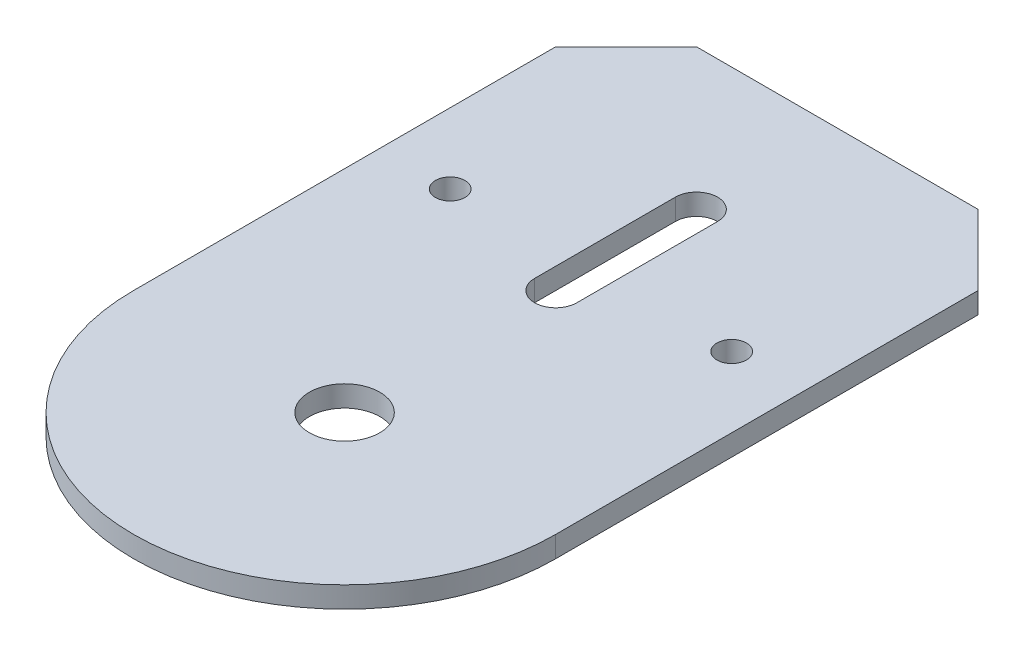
ISO-10303-21;
HEADER;
FILE_DESCRIPTION(('STEP AP214'),'2;1');
FILE_NAME('part.step','',(''),(''),'','','');
FILE_SCHEMA(('AUTOMOTIVE_DESIGN { 1 0 10303 214 1 1 1 1 }'));
ENDSEC;
DATA;
#1=APPLICATION_CONTEXT('core data for automotive mechanical design processes');
#2=APPLICATION_PROTOCOL_DEFINITION('international standard','automotive_design',2000,#1);
#3=PRODUCT_CONTEXT('',#1,'mechanical');
#4=PRODUCT('Part','Part','',(#3));
#5=PRODUCT_RELATED_PRODUCT_CATEGORY('part','',(#4));
#6=PRODUCT_DEFINITION_FORMATION('','',#4);
#7=PRODUCT_DEFINITION_CONTEXT('part definition',#1,'design');
#8=PRODUCT_DEFINITION('design','',#6,#7);
#9=PRODUCT_DEFINITION_SHAPE('','',#8);
#10=(LENGTH_UNIT() NAMED_UNIT(*) SI_UNIT(.MILLI.,.METRE.));
#11=(NAMED_UNIT(*) PLANE_ANGLE_UNIT() SI_UNIT($,.RADIAN.));
#12=(NAMED_UNIT(*) SI_UNIT($,.STERADIAN.) SOLID_ANGLE_UNIT());
#13=UNCERTAINTY_MEASURE_WITH_UNIT(LENGTH_MEASURE(1.E-05),#10,'distance_accuracy_value','');
#14=(GEOMETRIC_REPRESENTATION_CONTEXT(3) GLOBAL_UNCERTAINTY_ASSIGNED_CONTEXT((#13)) GLOBAL_UNIT_ASSIGNED_CONTEXT((#10,
#11,#12)) REPRESENTATION_CONTEXT('',''));
#15=CARTESIAN_POINT('',(0.,0.,0.));
#16=DIRECTION('',(0.,0.,1.));
#17=DIRECTION('',(1.,0.,0.));
#18=AXIS2_PLACEMENT_3D('',#15,#16,#17);
#19=CARTESIAN_POINT('',(0.,3.,0.));
#20=DIRECTION('',(0.,1.,0.));
#21=DIRECTION('',(0.,0.,1.));
#22=AXIS2_PLACEMENT_3D('',#19,#20,#21);
#23=PLANE('',#22);
#24=CARTESIAN_POINT('',(-20.,3.,-35.));
#25=DIRECTION('',(0.,1.,0.));
#26=DIRECTION('',(0.,0.,1.));
#27=AXIS2_PLACEMENT_3D('',#24,#25,#26);
#28=CIRCLE('',#27,2.1);
#29=CARTESIAN_POINT('',(-20.,3.,-32.9));
#30=VERTEX_POINT('',#29);
#31=EDGE_CURVE('E266',#30,#30,#28,.T.);
#32=ORIENTED_EDGE('',*,*,#31,.F.);
#33=EDGE_LOOP('',(#32));
#34=FACE_BOUND('',#33,.T.);
#35=CARTESIAN_POINT('',(20.,3.,-35.));
#36=DIRECTION('',(0.,1.,0.));
#37=DIRECTION('',(0.,0.,1.));
#38=AXIS2_PLACEMENT_3D('',#35,#36,#37);
#39=CIRCLE('',#38,2.1);
#40=CARTESIAN_POINT('',(20.,3.,-32.9));
#41=VERTEX_POINT('',#40);
#42=EDGE_CURVE('E268',#41,#41,#39,.T.);
#43=ORIENTED_EDGE('',*,*,#42,.F.);
#44=EDGE_LOOP('',(#43));
#45=FACE_BOUND('',#44,.T.);
#46=CARTESIAN_POINT('',(0.,3.,0.));
#47=DIRECTION('',(0.,1.,0.));
#48=DIRECTION('',(0.,0.,1.));
#49=AXIS2_PLACEMENT_3D('',#46,#47,#48);
#50=CIRCLE('',#49,5.);
#51=CARTESIAN_POINT('',(0.,3.,5.));
#52=VERTEX_POINT('',#51);
#53=EDGE_CURVE('E146',#52,#52,#50,.T.);
#54=ORIENTED_EDGE('',*,*,#53,.F.);
#55=EDGE_LOOP('',(#54));
#56=FACE_BOUND('',#55,.T.);
#57=DIRECTION('',(-0.707106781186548,0.,0.707106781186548));
#58=VECTOR('',#57,1.);
#59=CARTESIAN_POINT('',(-30.,3.,-60.));
#60=LINE('',#59,#58);
#61=CARTESIAN_POINT('',(-20.,3.,-70.));
#62=VERTEX_POINT('',#61);
#63=CARTESIAN_POINT('',(-30.,3.,-60.));
#64=VERTEX_POINT('',#63);
#65=EDGE_CURVE('E152',#62,#64,#60,.T.);
#66=ORIENTED_EDGE('',*,*,#65,.T.);
#67=DIRECTION('',(0.,0.,1.));
#68=VECTOR('',#67,1.);
#69=CARTESIAN_POINT('',(-30.,3.,0.));
#70=LINE('',#69,#68);
#71=CARTESIAN_POINT('',(-30.,3.,0.));
#72=VERTEX_POINT('',#71);
#73=EDGE_CURVE('E155',#64,#72,#70,.T.);
#74=ORIENTED_EDGE('',*,*,#73,.T.);
#75=CARTESIAN_POINT('',(0.,3.,0.));
#76=DIRECTION('',(0.,1.,0.));
#77=DIRECTION('',(0.,0.,1.));
#78=AXIS2_PLACEMENT_3D('',#75,#76,#77);
#79=CIRCLE('',#78,30.);
#80=CARTESIAN_POINT('',(30.,3.,0.));
#81=VERTEX_POINT('',#80);
#82=EDGE_CURVE('E158',#72,#81,#79,.T.);
#83=ORIENTED_EDGE('',*,*,#82,.T.);
#84=DIRECTION('',(0.,0.,-1.));
#85=VECTOR('',#84,1.);
#86=CARTESIAN_POINT('',(30.,3.,-60.));
#87=LINE('',#86,#85);
#88=CARTESIAN_POINT('',(30.,3.,-60.));
#89=VERTEX_POINT('',#88);
#90=EDGE_CURVE('E160',#81,#89,#87,.T.);
#91=ORIENTED_EDGE('',*,*,#90,.T.);
#92=DIRECTION('',(-0.707106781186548,0.,-0.707106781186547));
#93=VECTOR('',#92,1.);
#94=CARTESIAN_POINT('',(20.,3.,-70.));
#95=LINE('',#94,#93);
#96=CARTESIAN_POINT('',(20.,3.,-70.));
#97=VERTEX_POINT('',#96);
#98=EDGE_CURVE('E162',#89,#97,#95,.T.);
#99=ORIENTED_EDGE('',*,*,#98,.T.);
#100=DIRECTION('',(-1.,0.,0.));
#101=VECTOR('',#100,1.);
#102=CARTESIAN_POINT('',(-20.,3.,-70.));
#103=LINE('',#102,#101);
#104=EDGE_CURVE('E164',#97,#62,#103,.T.);
#105=ORIENTED_EDGE('',*,*,#104,.T.);
#106=EDGE_LOOP('',(#66,#74,#83,#91,#99,#105));
#107=FACE_BOUND('',#106,.T.);
#108=DIRECTION('',(0.,0.,-1.));
#109=VECTOR('',#108,1.);
#110=CARTESIAN_POINT('',(3.,3.,-30.));
#111=LINE('',#110,#109);
#112=CARTESIAN_POINT('',(3.,3.,-30.));
#113=VERTEX_POINT('',#112);
#114=CARTESIAN_POINT('',(3.,3.,-50.));
#115=VERTEX_POINT('',#114);
#116=EDGE_CURVE('E116',#113,#115,#111,.T.);
#117=ORIENTED_EDGE('',*,*,#116,.F.);
#118=CARTESIAN_POINT('',(0.,3.,-30.));
#119=DIRECTION('',(0.,1.,0.));
#120=DIRECTION('',(0.,0.,-1.));
#121=AXIS2_PLACEMENT_3D('',#118,#119,#120);
#122=CIRCLE('',#121,3.);
#123=CARTESIAN_POINT('',(-3.,3.,-30.));
#124=VERTEX_POINT('',#123);
#125=EDGE_CURVE('E108',#124,#113,#122,.T.);
#126=ORIENTED_EDGE('',*,*,#125,.F.);
#127=DIRECTION('',(0.,0.,1.));
#128=VECTOR('',#127,1.);
#129=CARTESIAN_POINT('',(-3.,3.,-30.));
#130=LINE('',#129,#128);
#131=CARTESIAN_POINT('',(-3.,3.,-50.));
#132=VERTEX_POINT('',#131);
#133=EDGE_CURVE('E130',#132,#124,#130,.T.);
#134=ORIENTED_EDGE('',*,*,#133,.F.);
#135=CARTESIAN_POINT('',(0.,3.,-50.));
#136=DIRECTION('',(0.,1.,0.));
#137=DIRECTION('',(0.,0.,1.));
#138=AXIS2_PLACEMENT_3D('',#135,#136,#137);
#139=CIRCLE('',#138,3.);
#140=EDGE_CURVE('E128',#115,#132,#139,.T.);
#141=ORIENTED_EDGE('',*,*,#140,.F.);
#142=EDGE_LOOP('',(#117,#126,#134,#141));
#143=FACE_BOUND('',#142,.T.);
#144=ADVANCED_FACE('F31',(#34,#45,#56,#107,#143),#23,.T.);
#145=CARTESIAN_POINT('',(0.,0.,0.));
#146=DIRECTION('',(0.,1.,0.));
#147=DIRECTION('',(0.,0.,1.));
#148=AXIS2_PLACEMENT_3D('',#145,#146,#147);
#149=PLANE('',#148);
#150=CARTESIAN_POINT('',(-20.,0.,-35.));
#151=DIRECTION('',(0.,1.,0.));
#152=DIRECTION('',(0.,0.,1.));
#153=AXIS2_PLACEMENT_3D('',#150,#151,#152);
#154=CIRCLE('',#153,2.1);
#155=CARTESIAN_POINT('',(-20.,0.,-32.9));
#156=VERTEX_POINT('',#155);
#157=EDGE_CURVE('E264',#156,#156,#154,.T.);
#158=ORIENTED_EDGE('',*,*,#157,.T.);
#159=EDGE_LOOP('',(#158));
#160=FACE_BOUND('',#159,.T.);
#161=CARTESIAN_POINT('',(20.,0.,-35.));
#162=DIRECTION('',(0.,1.,0.));
#163=DIRECTION('',(0.,0.,1.));
#164=AXIS2_PLACEMENT_3D('',#161,#162,#163);
#165=CIRCLE('',#164,2.1);
#166=CARTESIAN_POINT('',(20.,0.,-32.9));
#167=VERTEX_POINT('',#166);
#168=EDGE_CURVE('E136',#167,#167,#165,.T.);
#169=ORIENTED_EDGE('',*,*,#168,.T.);
#170=EDGE_LOOP('',(#169));
#171=FACE_BOUND('',#170,.T.);
#172=CARTESIAN_POINT('',(0.,0.,0.));
#173=DIRECTION('',(0.,1.,0.));
#174=DIRECTION('',(0.,0.,1.));
#175=AXIS2_PLACEMENT_3D('',#172,#173,#174);
#176=CIRCLE('',#175,5.);
#177=CARTESIAN_POINT('',(0.,0.,5.));
#178=VERTEX_POINT('',#177);
#179=EDGE_CURVE('E124',#178,#178,#176,.T.);
#180=ORIENTED_EDGE('',*,*,#179,.T.);
#181=EDGE_LOOP('',(#180));
#182=FACE_BOUND('',#181,.T.);
#183=DIRECTION('',(-0.707106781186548,0.,0.707106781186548));
#184=VECTOR('',#183,1.);
#185=CARTESIAN_POINT('',(-30.,0.,-60.));
#186=LINE('',#185,#184);
#187=CARTESIAN_POINT('',(-20.,0.,-70.));
#188=VERTEX_POINT('',#187);
#189=CARTESIAN_POINT('',(-30.,0.,-60.));
#190=VERTEX_POINT('',#189);
#191=EDGE_CURVE('E149',#188,#190,#186,.T.);
#192=ORIENTED_EDGE('',*,*,#191,.F.);
#193=DIRECTION('',(-1.,0.,0.));
#194=VECTOR('',#193,1.);
#195=CARTESIAN_POINT('',(-20.,0.,-70.));
#196=LINE('',#195,#194);
#197=CARTESIAN_POINT('',(20.,0.,-70.));
#198=VERTEX_POINT('',#197);
#199=EDGE_CURVE('E156',#198,#188,#196,.T.);
#200=ORIENTED_EDGE('',*,*,#199,.F.);
#201=DIRECTION('',(-0.707106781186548,0.,-0.707106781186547));
#202=VECTOR('',#201,1.);
#203=CARTESIAN_POINT('',(20.,0.,-70.));
#204=LINE('',#203,#202);
#205=CARTESIAN_POINT('',(30.,0.,-60.));
#206=VERTEX_POINT('',#205);
#207=EDGE_CURVE('E175',#206,#198,#204,.T.);
#208=ORIENTED_EDGE('',*,*,#207,.F.);
#209=DIRECTION('',(0.,0.,-1.));
#210=VECTOR('',#209,1.);
#211=CARTESIAN_POINT('',(30.,0.,-60.));
#212=LINE('',#211,#210);
#213=CARTESIAN_POINT('',(30.,0.,0.));
#214=VERTEX_POINT('',#213);
#215=EDGE_CURVE('E173',#214,#206,#212,.T.);
#216=ORIENTED_EDGE('',*,*,#215,.F.);
#217=CARTESIAN_POINT('',(0.,0.,0.));
#218=DIRECTION('',(0.,1.,0.));
#219=DIRECTION('',(0.,0.,1.));
#220=AXIS2_PLACEMENT_3D('',#217,#218,#219);
#221=CIRCLE('',#220,30.);
#222=CARTESIAN_POINT('',(-30.,0.,0.));
#223=VERTEX_POINT('',#222);
#224=EDGE_CURVE('E171',#223,#214,#221,.T.);
#225=ORIENTED_EDGE('',*,*,#224,.F.);
#226=DIRECTION('',(0.,0.,1.));
#227=VECTOR('',#226,1.);
#228=CARTESIAN_POINT('',(-30.,0.,0.));
#229=LINE('',#228,#227);
#230=EDGE_CURVE('E169',#190,#223,#229,.T.);
#231=ORIENTED_EDGE('',*,*,#230,.F.);
#232=EDGE_LOOP('',(#192,#200,#208,#216,#225,#231));
#233=FACE_BOUND('',#232,.T.);
#234=CARTESIAN_POINT('',(0.,0.,-30.));
#235=DIRECTION('',(0.,1.,0.));
#236=DIRECTION('',(0.,0.,-1.));
#237=AXIS2_PLACEMENT_3D('',#234,#235,#236);
#238=CIRCLE('',#237,3.);
#239=CARTESIAN_POINT('',(-3.,0.,-30.));
#240=VERTEX_POINT('',#239);
#241=CARTESIAN_POINT('',(3.,0.,-30.));
#242=VERTEX_POINT('',#241);
#243=EDGE_CURVE('E54',#240,#242,#238,.T.);
#244=ORIENTED_EDGE('',*,*,#243,.T.);
#245=DIRECTION('',(0.,0.,-1.));
#246=VECTOR('',#245,1.);
#247=CARTESIAN_POINT('',(3.,0.,-30.));
#248=LINE('',#247,#246);
#249=CARTESIAN_POINT('',(3.,0.,-50.));
#250=VERTEX_POINT('',#249);
#251=EDGE_CURVE('E123',#242,#250,#248,.T.);
#252=ORIENTED_EDGE('',*,*,#251,.T.);
#253=CARTESIAN_POINT('',(0.,0.,-50.));
#254=DIRECTION('',(0.,1.,0.));
#255=DIRECTION('',(0.,0.,1.));
#256=AXIS2_PLACEMENT_3D('',#253,#254,#255);
#257=CIRCLE('',#256,3.);
#258=CARTESIAN_POINT('',(-3.,0.,-50.));
#259=VERTEX_POINT('',#258);
#260=EDGE_CURVE('E138',#250,#259,#257,.T.);
#261=ORIENTED_EDGE('',*,*,#260,.T.);
#262=DIRECTION('',(0.,0.,1.));
#263=VECTOR('',#262,1.);
#264=CARTESIAN_POINT('',(-3.,0.,-30.));
#265=LINE('',#264,#263);
#266=EDGE_CURVE('E117',#259,#240,#265,.T.);
#267=ORIENTED_EDGE('',*,*,#266,.T.);
#268=EDGE_LOOP('',(#244,#252,#261,#267));
#269=FACE_BOUND('',#268,.T.);
#270=ADVANCED_FACE('F199',(#160,#171,#182,#233,#269),#149,.F.);
#271=CARTESIAN_POINT('',(-30.,3.,-60.));
#272=DIRECTION('',(0.707106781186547,0.,0.707106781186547));
#273=DIRECTION('',(0.707106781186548,0.,-0.707106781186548));
#274=AXIS2_PLACEMENT_3D('',#271,#272,#273);
#275=PLANE('',#274);
#276=ORIENTED_EDGE('',*,*,#191,.T.);
#277=DIRECTION('',(0.,-1.,0.));
#278=VECTOR('',#277,1.);
#279=CARTESIAN_POINT('',(-30.,3.,-60.));
#280=LINE('',#279,#278);
#281=EDGE_CURVE('E11',#64,#190,#280,.T.);
#282=ORIENTED_EDGE('',*,*,#281,.F.);
#283=ORIENTED_EDGE('',*,*,#65,.F.);
#284=DIRECTION('',(0.,-1.,0.));
#285=VECTOR('',#284,1.);
#286=CARTESIAN_POINT('',(-20.,3.,-70.));
#287=LINE('',#286,#285);
#288=EDGE_CURVE('E166',#62,#188,#287,.T.);
#289=ORIENTED_EDGE('',*,*,#288,.T.);
#290=EDGE_LOOP('',(#276,#282,#283,#289));
#291=FACE_BOUND('',#290,.T.);
#292=ADVANCED_FACE('F33',(#291),#275,.F.);
#293=CARTESIAN_POINT('',(-30.,3.,0.));
#294=DIRECTION('',(1.,0.,0.));
#295=DIRECTION('',(0.,0.,-1.));
#296=AXIS2_PLACEMENT_3D('',#293,#294,#295);
#297=PLANE('',#296);
#298=ORIENTED_EDGE('',*,*,#230,.T.);
#299=DIRECTION('',(0.,-1.,0.));
#300=VECTOR('',#299,1.);
#301=CARTESIAN_POINT('',(-30.,3.,0.));
#302=LINE('',#301,#300);
#303=EDGE_CURVE('E39',#72,#223,#302,.T.);
#304=ORIENTED_EDGE('',*,*,#303,.F.);
#305=ORIENTED_EDGE('',*,*,#73,.F.);
#306=ORIENTED_EDGE('',*,*,#281,.T.);
#307=EDGE_LOOP('',(#298,#304,#305,#306));
#308=FACE_BOUND('',#307,.T.);
#309=ADVANCED_FACE('F216',(#308),#297,.F.);
#310=CARTESIAN_POINT('',(0.,3.,0.));
#311=DIRECTION('',(0.,-1.,0.));
#312=DIRECTION('',(0.,0.,-1.));
#313=AXIS2_PLACEMENT_3D('',#310,#311,#312);
#314=CYLINDRICAL_SURFACE('',#313,30.);
#315=ORIENTED_EDGE('',*,*,#224,.T.);
#316=DIRECTION('',(0.,-1.,0.));
#317=VECTOR('',#316,1.);
#318=CARTESIAN_POINT('',(30.,3.,0.));
#319=LINE('',#318,#317);
#320=EDGE_CURVE('E186',#81,#214,#319,.T.);
#321=ORIENTED_EDGE('',*,*,#320,.F.);
#322=ORIENTED_EDGE('',*,*,#82,.F.);
#323=ORIENTED_EDGE('',*,*,#303,.T.);
#324=EDGE_LOOP('',(#315,#321,#322,#323));
#325=FACE_BOUND('',#324,.T.);
#326=ADVANCED_FACE('F193',(#325),#314,.T.);
#327=CARTESIAN_POINT('',(30.,3.,-60.));
#328=DIRECTION('',(-1.,0.,0.));
#329=DIRECTION('',(0.,0.,1.));
#330=AXIS2_PLACEMENT_3D('',#327,#328,#329);
#331=PLANE('',#330);
#332=ORIENTED_EDGE('',*,*,#215,.T.);
#333=DIRECTION('',(0.,-1.,0.));
#334=VECTOR('',#333,1.);
#335=CARTESIAN_POINT('',(30.,3.,-60.));
#336=LINE('',#335,#334);
#337=EDGE_CURVE('E183',#89,#206,#336,.T.);
#338=ORIENTED_EDGE('',*,*,#337,.F.);
#339=ORIENTED_EDGE('',*,*,#90,.F.);
#340=ORIENTED_EDGE('',*,*,#320,.T.);
#341=EDGE_LOOP('',(#332,#338,#339,#340));
#342=FACE_BOUND('',#341,.T.);
#343=ADVANCED_FACE('F205',(#342),#331,.F.);
#344=CARTESIAN_POINT('',(20.,3.,-70.));
#345=DIRECTION('',(-0.707106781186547,0.,0.707106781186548));
#346=DIRECTION('',(0.707106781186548,0.,0.707106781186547));
#347=AXIS2_PLACEMENT_3D('',#344,#345,#346);
#348=PLANE('',#347);
#349=ORIENTED_EDGE('',*,*,#207,.T.);
#350=DIRECTION('',(0.,-1.,0.));
#351=VECTOR('',#350,1.);
#352=CARTESIAN_POINT('',(20.,3.,-70.));
#353=LINE('',#352,#351);
#354=EDGE_CURVE('E180',#97,#198,#353,.T.);
#355=ORIENTED_EDGE('',*,*,#354,.F.);
#356=ORIENTED_EDGE('',*,*,#98,.F.);
#357=ORIENTED_EDGE('',*,*,#337,.T.);
#358=EDGE_LOOP('',(#349,#355,#356,#357));
#359=FACE_BOUND('',#358,.T.);
#360=ADVANCED_FACE('F209',(#359),#348,.F.);
#361=CARTESIAN_POINT('',(-20.,3.,-70.));
#362=DIRECTION('',(0.,0.,1.));
#363=DIRECTION('',(1.,0.,0.));
#364=AXIS2_PLACEMENT_3D('',#361,#362,#363);
#365=PLANE('',#364);
#366=ORIENTED_EDGE('',*,*,#199,.T.);
#367=ORIENTED_EDGE('',*,*,#288,.F.);
#368=ORIENTED_EDGE('',*,*,#104,.F.);
#369=ORIENTED_EDGE('',*,*,#354,.T.);
#370=EDGE_LOOP('',(#366,#367,#368,#369));
#371=FACE_BOUND('',#370,.T.);
#372=ADVANCED_FACE('F219',(#371),#365,.F.);
#373=CARTESIAN_POINT('',(0.,3.,0.));
#374=DIRECTION('',(0.,-1.,0.));
#375=DIRECTION('',(0.,0.,-1.));
#376=AXIS2_PLACEMENT_3D('',#373,#374,#375);
#377=CYLINDRICAL_SURFACE('',#376,5.);
#378=ORIENTED_EDGE('',*,*,#53,.T.);
#379=EDGE_LOOP('',(#378));
#380=FACE_BOUND('',#379,.T.);
#381=ORIENTED_EDGE('',*,*,#179,.F.);
#382=EDGE_LOOP('',(#381));
#383=FACE_BOUND('',#382,.T.);
#384=ADVANCED_FACE('F221',(#380,#383),#377,.F.);
#385=CARTESIAN_POINT('',(0.,3.,-30.));
#386=DIRECTION('',(0.,-1.,0.));
#387=DIRECTION('',(0.,0.,-1.));
#388=AXIS2_PLACEMENT_3D('',#385,#386,#387);
#389=CYLINDRICAL_SURFACE('',#388,3.);
#390=ORIENTED_EDGE('',*,*,#243,.F.);
#391=DIRECTION('',(0.,-1.,0.));
#392=VECTOR('',#391,1.);
#393=CARTESIAN_POINT('',(-3.,3.,-30.));
#394=LINE('',#393,#392);
#395=EDGE_CURVE('E112',#124,#240,#394,.T.);
#396=ORIENTED_EDGE('',*,*,#395,.F.);
#397=ORIENTED_EDGE('',*,*,#125,.T.);
#398=DIRECTION('',(0.,-1.,0.));
#399=VECTOR('',#398,1.);
#400=CARTESIAN_POINT('',(3.,3.,-30.));
#401=LINE('',#400,#399);
#402=EDGE_CURVE('E111',#113,#242,#401,.T.);
#403=ORIENTED_EDGE('',*,*,#402,.T.);
#404=EDGE_LOOP('',(#390,#396,#397,#403));
#405=FACE_BOUND('',#404,.T.);
#406=ADVANCED_FACE('F110',(#405),#389,.F.);
#407=CARTESIAN_POINT('',(3.,3.,-30.));
#408=DIRECTION('',(-1.,0.,0.));
#409=DIRECTION('',(0.,0.,1.));
#410=AXIS2_PLACEMENT_3D('',#407,#408,#409);
#411=PLANE('',#410);
#412=ORIENTED_EDGE('',*,*,#251,.F.);
#413=ORIENTED_EDGE('',*,*,#402,.F.);
#414=ORIENTED_EDGE('',*,*,#116,.T.);
#415=DIRECTION('',(0.,-1.,0.));
#416=VECTOR('',#415,1.);
#417=CARTESIAN_POINT('',(3.,3.,-50.));
#418=LINE('',#417,#416);
#419=EDGE_CURVE('E125',#115,#250,#418,.T.);
#420=ORIENTED_EDGE('',*,*,#419,.T.);
#421=EDGE_LOOP('',(#412,#413,#414,#420));
#422=FACE_BOUND('',#421,.T.);
#423=ADVANCED_FACE('F120',(#422),#411,.T.);
#424=CARTESIAN_POINT('',(0.,3.,-50.));
#425=DIRECTION('',(0.,-1.,0.));
#426=DIRECTION('',(0.,0.,-1.));
#427=AXIS2_PLACEMENT_3D('',#424,#425,#426);
#428=CYLINDRICAL_SURFACE('',#427,3.);
#429=ORIENTED_EDGE('',*,*,#260,.F.);
#430=ORIENTED_EDGE('',*,*,#419,.F.);
#431=ORIENTED_EDGE('',*,*,#140,.T.);
#432=DIRECTION('',(0.,-1.,0.));
#433=VECTOR('',#432,1.);
#434=CARTESIAN_POINT('',(-3.,3.,-50.));
#435=LINE('',#434,#433);
#436=EDGE_CURVE('E46',#132,#259,#435,.T.);
#437=ORIENTED_EDGE('',*,*,#436,.T.);
#438=EDGE_LOOP('',(#429,#430,#431,#437));
#439=FACE_BOUND('',#438,.T.);
#440=ADVANCED_FACE('F245',(#439),#428,.F.);
#441=CARTESIAN_POINT('',(-3.,3.,-30.));
#442=DIRECTION('',(1.,0.,0.));
#443=DIRECTION('',(0.,0.,-1.));
#444=AXIS2_PLACEMENT_3D('',#441,#442,#443);
#445=PLANE('',#444);
#446=ORIENTED_EDGE('',*,*,#266,.F.);
#447=ORIENTED_EDGE('',*,*,#436,.F.);
#448=ORIENTED_EDGE('',*,*,#133,.T.);
#449=ORIENTED_EDGE('',*,*,#395,.T.);
#450=EDGE_LOOP('',(#446,#447,#448,#449));
#451=FACE_BOUND('',#450,.T.);
#452=ADVANCED_FACE('F248',(#451),#445,.T.);
#453=CARTESIAN_POINT('',(20.,3.,-35.));
#454=DIRECTION('',(0.,1.,0.));
#455=DIRECTION('',(0.,0.,1.));
#456=AXIS2_PLACEMENT_3D('',#453,#454,#455);
#457=CYLINDRICAL_SURFACE('',#456,2.1);
#458=ORIENTED_EDGE('',*,*,#168,.F.);
#459=EDGE_LOOP('',(#458));
#460=FACE_BOUND('',#459,.T.);
#461=ORIENTED_EDGE('',*,*,#42,.T.);
#462=EDGE_LOOP('',(#461));
#463=FACE_BOUND('',#462,.T.);
#464=ADVANCED_FACE('F252',(#460,#463),#457,.F.);
#465=CARTESIAN_POINT('',(-20.,3.,-35.));
#466=DIRECTION('',(0.,1.,0.));
#467=DIRECTION('',(0.,0.,1.));
#468=AXIS2_PLACEMENT_3D('',#465,#466,#467);
#469=CYLINDRICAL_SURFACE('',#468,2.1);
#470=ORIENTED_EDGE('',*,*,#157,.F.);
#471=EDGE_LOOP('',(#470));
#472=FACE_BOUND('',#471,.T.);
#473=ORIENTED_EDGE('',*,*,#31,.T.);
#474=EDGE_LOOP('',(#473));
#475=FACE_BOUND('',#474,.T.);
#476=ADVANCED_FACE('F255',(#472,#475),#469,.F.);
#477=CLOSED_SHELL('',(#144,#270,#292,#309,#326,#343,#360,#372,#384,#406,#423,#440,#452,#464,#476));
#478=MANIFOLD_SOLID_BREP('B2',#477);
#479=ADVANCED_BREP_SHAPE_REPRESENTATION('',(#18,#478),#14);
#480=SHAPE_DEFINITION_REPRESENTATION(#9,#479);
ENDSEC;
END-ISO-10303-21;
